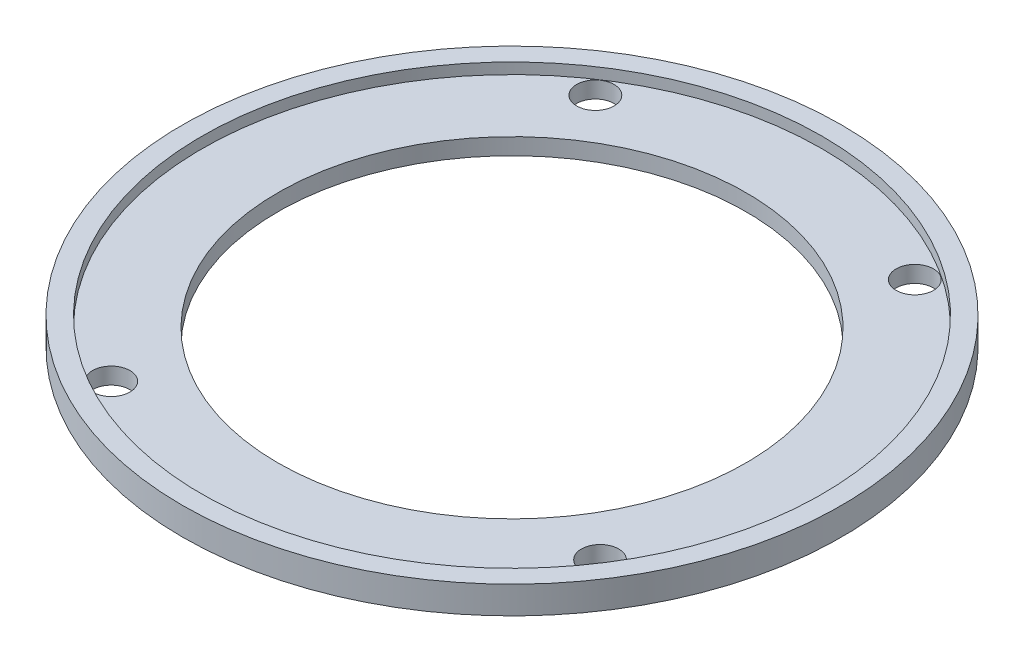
from build123d import *

# Parameters (mm, degrees)
SKETCH1_R           = 29.337
SKETCH1_R_2         = 22.28215
BOSS_EXTRUDE1_DEPTH = 1.5748
SKETCH2_R           = 1.651
SKETCH2_R_2         = 0.762
BOSS_EXTRUDE2_DEPTH = 6.5024
SKETCH4_R           = 31.369
SKETCH4_R_2         = 29.337
BOSS_EXTRUDE3_DEPTH = 1.5748
SKETCH5_R           = 1.778
CUT_EXTRUDE2_DEPTH  = 46.091789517
SKETCH6_R           = 31.369
SKETCH6_R_2         = 29.5148
BOSS_EXTRUDE4_DEPTH = 1.0414


with BuildPart() as part:
    # Sketch1 → Boss-Extrude1 (new body)
    with BuildSketch(Plane(origin=(0, 0, 0), x_dir=(1, 0, 0), z_dir=(0, 1, 0))):
        with Locations(Location((0, 0, 0), (0, 0, 270))):
            Circle(SKETCH1_R)
        with Locations(Location((0, 0, 0), (0, 0, 270))):
            Circle(SKETCH1_R_2, mode=Mode.SUBTRACT)
    extrude(amount=BOSS_EXTRUDE1_DEPTH)

    # Sketch2 → Boss-Extrude2 (add)
    # profile 1 of 4: a face of its own
    with BuildSketch(Plane.XZ):
        with Locations(Location((23.314362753, 14.931680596, 0), (0, 0, 32.636876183))):
            Circle(SKETCH2_R)
        with Locations(Location((23.314362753, 14.931680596, 0), (0, 0, 270))):
            Circle(SKETCH2_R_2, mode=Mode.SUBTRACT)
    # profile 2 of 4: a face of its own
    with BuildSketch(Plane.XZ):
        with Locations(Location((15.2019, -23.139075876, 0), (0, 0, 303.303446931))):
            Circle(SKETCH2_R)
        with Locations(Location((15.2019, -23.139075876, 0), (0, 0, 270))):
            Circle(SKETCH2_R_2, mode=Mode.SUBTRACT)
    # profile 3 of 4: a face of its own
    with BuildSketch(Plane.XZ):
        with Locations(Location((-15.2019, -23.139075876, 0), (0, 0, 236.695254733))):
            Circle(SKETCH2_R)
        with Locations(Location((-15.2019, -23.139075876, 0), (0, 0, 270))):
            Circle(SKETCH2_R_2, mode=Mode.SUBTRACT)
    # profile 4 of 4: a face of its own
    with BuildSketch(Plane.XZ):
        with Locations(Location((-14.659440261, 23.486494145, 0), (0, 0, 121.970304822))):
            Circle(SKETCH2_R)
        with Locations(Location((-14.659440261, 23.486494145, 0), (0, 0, 270))):
            Circle(SKETCH2_R_2, mode=Mode.SUBTRACT)
    extrude(amount=BOSS_EXTRUDE2_DEPTH)

    # Sketch4 → Boss-Extrude3 (add)
    with BuildSketch(Plane.XZ):
        with Locations(Location((0, 0, 0), (0, 0, 270))):
            Circle(SKETCH4_R)
        Circle(SKETCH4_R_2, mode=Mode.SUBTRACT)
    extrude(amount=-BOSS_EXTRUDE3_DEPTH)

    # Sketch5 → Cut-Extrude2 (cut, through all)
    with BuildSketch(Plane.XZ.offset(6.5024)):
        with Locations(Location((-14.659440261, 23.486494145, 0), (0, 0, 270))):
            Circle(SKETCH5_R)
        with Locations(Location((23.314362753, 14.931680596, 0), (0, 0, 270))):
            Circle(SKETCH5_R)
        with Locations(Location((15.2019, -23.139075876, 0), (0, 0, 270))):
            Circle(SKETCH5_R)
        with Locations(Location((-15.2019, -23.139075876, 0), (0, 0, 270))):
            Circle(SKETCH5_R)
    extrude(amount=-CUT_EXTRUDE2_DEPTH, mode=Mode.SUBTRACT)

    # Sketch6 → Boss-Extrude4 (add)
    with BuildSketch(Plane(origin=(0, 1.5748, 0), x_dir=(1, 0, 0), z_dir=(0, 1, 0))):
        with Locations(Location((0, 0, 0), (0, 0, 90))):
            Circle(SKETCH6_R)
        with Locations(Location((0, 0, 0), (0, 0, 90))):
            Circle(SKETCH6_R_2, mode=Mode.SUBTRACT)
    extrude(amount=BOSS_EXTRUDE4_DEPTH)


solid = part.part
